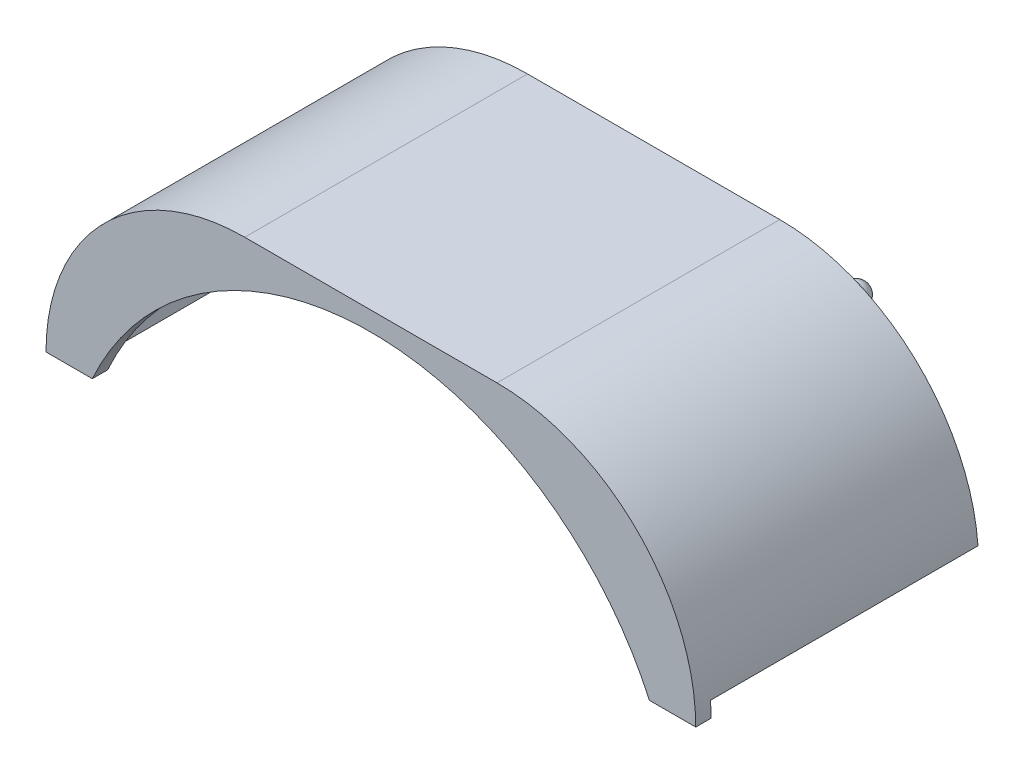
from build123d import *

# Parameters (mm, degrees)
BASE_EXTRUSION_DEPTH    = 35
BOSS_EXTRU_1_DEPTH      = 2
ESQUISSE4_W             = 2
ESQUISSE4_H             = 4
ENL_V_MAT_EXTRU_1_DEPTH = 30
BOSS_EXTRU_2_START      = 3
ESQUISSE5_R             = 1.5
BOSS_EXTRU_2_DEPTH      = 3
CONG_1_R                = 1.5


with BuildPart() as part:
    # Esquisse2 → Base-Extrusion (new body)
    with BuildSketch(Plane(origin=(-29.088082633, 3.493421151, 0), x_dir=(1, 0, 0), z_dir=(0, 0, 1))):
        with BuildLine():
            Line((11.088082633, 35.006578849), (11.088082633, 34.006578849))
            Line((11.088082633, 34.006578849), (13.088082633, 34.006578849))
            Line((13.088082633, 34.006578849), (13.088082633, 38.006578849))
            Line((13.088082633, 38.006578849), (45.088082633, 38.006578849))
            Line((45.088082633, 38.006578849), (45.088082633, 34.006578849))
            Line((45.088082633, 34.006578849), (47.088082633, 34.006578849))
            Line((47.088082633, 34.006578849), (47.088082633, 35.006578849))
            Line((47.088082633, 35.006578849), (46.088082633, 35.006578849))
            Line((46.088082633, 35.006578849), (46.088082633, 38.001578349))
            ThreePointArc((46.088082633, 38.001578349), (49.37093949, 37.718721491), (52.588082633, 37.006578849))
            Line((52.588082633, 37.006578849), (52.588082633, 34.006578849))
            ThreePointArc((52.588082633, 34.006578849), (54.088082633, 32.506578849), (55.588082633, 34.006578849))
            Line((55.588082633, 34.006578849), (55.588082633, 35.919457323))
            ThreePointArc((55.588082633, 35.919457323), (62.513280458, 31.405972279), (67.588082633, 24.880920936))
            Line((67.588082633, 24.880920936), (67.588082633, 13.006578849))
            Line((67.588082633, 13.006578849), (68.588082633, 13.006578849))
            Line((68.588082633, 13.006578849), (68.588082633, 15.006578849))
            Line((68.588082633, 15.006578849), (71.511045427, 15.006578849))
            ThreePointArc((71.511045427, 15.006578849), (63.251604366, 32.085362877), (45.588082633, 39.006578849))
            Line((45.588082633, 39.006578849), (12.588082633, 39.006578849))
            ThreePointArc((12.588082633, 39.006578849), (-5.075439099, 32.085362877), (-13.33488016, 15.006578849))
            Line((-13.33488016, 15.006578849), (-10.411917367, 15.006578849))
            Line((-10.411917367, 15.006578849), (-10.411917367, 13.006578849))
            Line((-10.411917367, 13.006578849), (-9.411917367, 13.006578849))
            Line((-9.411917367, 13.006578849), (-9.411917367, 24.880920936))
            ThreePointArc((-9.411917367, 24.880920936), (-4.337115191, 31.405972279), (2.588082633, 35.919457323))
            Line((2.588082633, 35.919457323), (2.588082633, 34.006578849))
            ThreePointArc((2.588082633, 34.006578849), (4.088082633, 32.506578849), (5.588082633, 34.006578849))
            Line((5.588082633, 34.006578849), (5.588082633, 37.006578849))
            ThreePointArc((5.588082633, 37.006578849), (8.805225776, 37.718721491), (12.088082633, 38.001578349))
            Line((12.088082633, 38.001578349), (12.088082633, 35.006578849))
            Line((12.088082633, 35.006578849), (11.088082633, 35.006578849))
        make_face()
    extrude(amount=BASE_EXTRUSION_DEPTH)

    # Esquisse3 → Boss.-Extru.1 (add)
    with BuildSketch(Plane.XY.offset(35)):
        with BuildLine():
            Line((-16.5, 42.5), (16.5, 42.5))
            ThreePointArc((16.5, 42.5), (34.884776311, 34.884776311), (42.5, 16.5))
            Line((42.5, 16.5), (36.438304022, 16.5))
            ThreePointArc((36.438304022, 16.5), (0, 40), (-36.438304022, 16.5))
            Line((-36.438304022, 16.5), (-42.5, 16.5))
            ThreePointArc((-42.5, 16.5), (-34.884776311, 34.884776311), (-16.5, 42.5))
        make_face()
    extrude(amount=BOSS_EXTRU_1_DEPTH)

    # Esquisse4 → Enl_v. mat.-Extru.1 (cut)
    with BuildSketch(Plane(origin=(0, 0, 0), x_dir=(-1, 0, 0), z_dir=(0, 0, -1))):
        with Locations((17, 39.5)):
            Rectangle(ESQUISSE4_W, ESQUISSE4_H)
        with Locations((-17, 39.5)):
            Rectangle(ESQUISSE4_W, ESQUISSE4_H)
    extrude(amount=-ENL_V_MAT_EXTRU_1_DEPTH, mode=Mode.SUBTRACT)

    # Esquisse5 → Boss.-Extru.2 (add)
    with BuildSketch(Plane(origin=(0, 0, 0), x_dir=(-1, 0, 0), z_dir=(0, 0, -1)).offset(BOSS_EXTRU_2_START)):
        with Locations((25, 37.5)):
            Circle(ESQUISSE5_R)
        with Locations((-25, 37.5)):
            Circle(ESQUISSE5_R)
    extrude(amount=-BOSS_EXTRU_2_DEPTH)

    # Cong_1
    cong_1_edges = [part.edges().sort_by_distance(p)[0] for p in [
        (-23.5, 37.5, -3),
        (26.5, 37.5, -3),
    ]]
    fillet(cong_1_edges, radius=CONG_1_R)


solid = part.part
